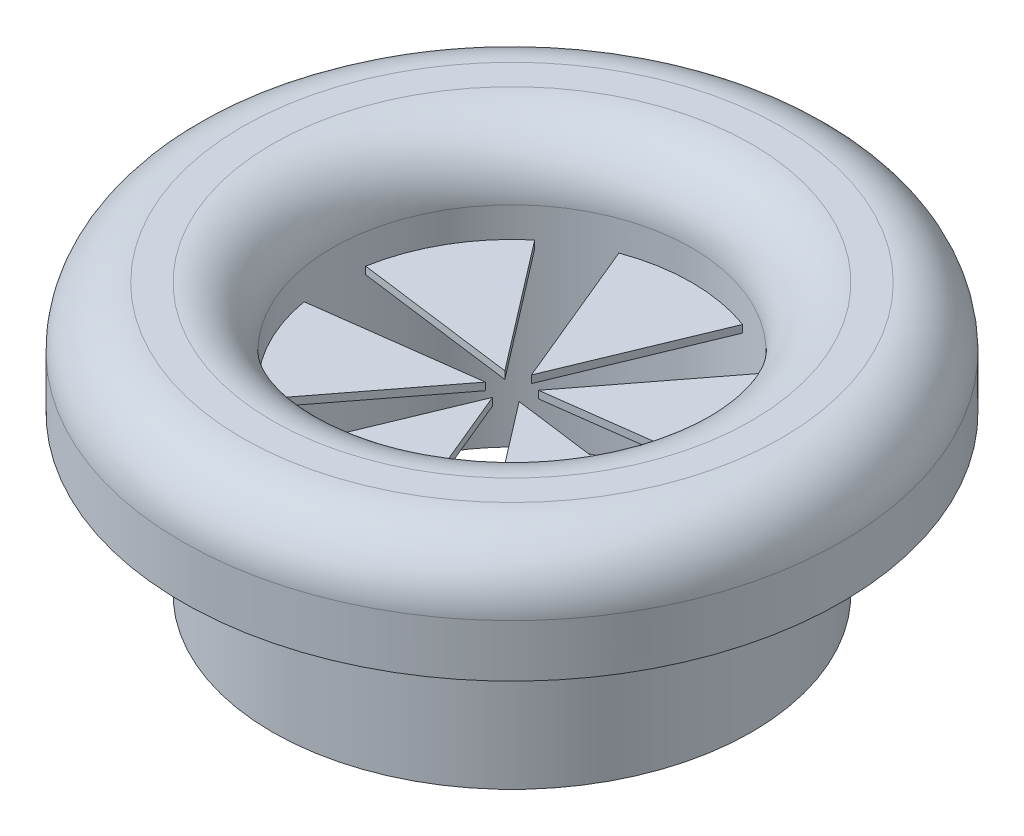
ISO-10303-21;
HEADER;
FILE_DESCRIPTION(('STEP AP214'),'2;1');
FILE_NAME('part.step','',(''),(''),'','','');
FILE_SCHEMA(('AUTOMOTIVE_DESIGN { 1 0 10303 214 1 1 1 1 }'));
ENDSEC;
DATA;
#1=APPLICATION_CONTEXT('core data for automotive mechanical design processes');
#2=APPLICATION_PROTOCOL_DEFINITION('international standard','automotive_design',2000,#1);
#3=PRODUCT_CONTEXT('',#1,'mechanical');
#4=PRODUCT('Part','Part','',(#3));
#5=PRODUCT_RELATED_PRODUCT_CATEGORY('part','',(#4));
#6=PRODUCT_DEFINITION_FORMATION('','',#4);
#7=PRODUCT_DEFINITION_CONTEXT('part definition',#1,'design');
#8=PRODUCT_DEFINITION('design','',#6,#7);
#9=PRODUCT_DEFINITION_SHAPE('','',#8);
#10=(LENGTH_UNIT() NAMED_UNIT(*) SI_UNIT(.MILLI.,.METRE.));
#11=(NAMED_UNIT(*) PLANE_ANGLE_UNIT() SI_UNIT($,.RADIAN.));
#12=(NAMED_UNIT(*) SI_UNIT($,.STERADIAN.) SOLID_ANGLE_UNIT());
#13=UNCERTAINTY_MEASURE_WITH_UNIT(LENGTH_MEASURE(1.E-05),#10,'distance_accuracy_value','');
#14=(GEOMETRIC_REPRESENTATION_CONTEXT(3) GLOBAL_UNCERTAINTY_ASSIGNED_CONTEXT((#13)) GLOBAL_UNIT_ASSIGNED_CONTEXT((#10,
#11,#12)) REPRESENTATION_CONTEXT('',''));
#15=CARTESIAN_POINT('',(0.,0.,0.));
#16=DIRECTION('',(0.,0.,1.));
#17=DIRECTION('',(1.,0.,0.));
#18=AXIS2_PLACEMENT_3D('',#15,#16,#17);
#19=CARTESIAN_POINT('',(0.,9.,0.));
#20=DIRECTION('',(0.,-1.,0.));
#21=DIRECTION('',(0.,0.,-1.));
#22=AXIS2_PLACEMENT_3D('',#19,#20,#21);
#23=CYLINDRICAL_SURFACE('',#22,11.);
#24=CARTESIAN_POINT('',(0.,7.,0.));
#25=DIRECTION('',(0.,1.,0.));
#26=DIRECTION('',(0.,0.,1.));
#27=AXIS2_PLACEMENT_3D('',#24,#25,#26);
#28=CIRCLE('',#27,11.);
#29=CARTESIAN_POINT('',(0.,7.,11.));
#30=VERTEX_POINT('',#29);
#31=EDGE_CURVE('E40',#30,#30,#28,.F.);
#32=ORIENTED_EDGE('',*,*,#31,.T.);
#33=EDGE_LOOP('',(#32));
#34=FACE_BOUND('',#33,.T.);
#35=CARTESIAN_POINT('',(0.,5.25,0.));
#36=DIRECTION('',(0.,-1.,0.));
#37=DIRECTION('',(0.,0.,-1.));
#38=AXIS2_PLACEMENT_3D('',#35,#36,#37);
#39=CIRCLE('',#38,11.);
#40=CARTESIAN_POINT('',(0.,5.25,-11.));
#41=VERTEX_POINT('',#40);
#42=EDGE_CURVE('E186',#41,#41,#39,.T.);
#43=ORIENTED_EDGE('',*,*,#42,.F.);
#44=EDGE_LOOP('',(#43));
#45=FACE_BOUND('',#44,.T.);
#46=ADVANCED_FACE('F32',(#34,#45),#23,.T.);
#47=CARTESIAN_POINT('',(0.,5.,0.));
#48=DIRECTION('',(0.,1.,0.));
#49=DIRECTION('',(0.,0.,1.));
#50=AXIS2_PLACEMENT_3D('',#47,#48,#49);
#51=PLANE('',#50);
#52=CARTESIAN_POINT('',(0.,5.,0.));
#53=DIRECTION('',(0.,1.,0.));
#54=DIRECTION('',(0.,0.,1.));
#55=AXIS2_PLACEMENT_3D('',#52,#53,#54);
#56=CIRCLE('',#55,8.);
#57=CARTESIAN_POINT('',(0.,5.,8.));
#58=VERTEX_POINT('',#57);
#59=EDGE_CURVE('E307',#58,#58,#56,.T.);
#60=ORIENTED_EDGE('',*,*,#59,.T.);
#61=EDGE_LOOP('',(#60));
#62=FACE_BOUND('',#61,.T.);
#63=CARTESIAN_POINT('',(0.,5.,0.));
#64=DIRECTION('',(0.,-1.,0.));
#65=DIRECTION('',(0.,0.,-1.));
#66=AXIS2_PLACEMENT_3D('',#63,#64,#65);
#67=CIRCLE('',#66,10.);
#68=CARTESIAN_POINT('',(0.,5.,-10.));
#69=VERTEX_POINT('',#68);
#70=EDGE_CURVE('E408',#69,#69,#67,.T.);
#71=ORIENTED_EDGE('',*,*,#70,.T.);
#72=EDGE_LOOP('',(#71));
#73=FACE_BOUND('',#72,.T.);
#74=ADVANCED_FACE('F343',(#62,#73),#51,.F.);
#75=CARTESIAN_POINT('',(0.,0.,0.));
#76=DIRECTION('',(0.,1.,0.));
#77=DIRECTION('',(0.,0.,1.));
#78=AXIS2_PLACEMENT_3D('',#75,#76,#77);
#79=CYLINDRICAL_SURFACE('',#78,6.);
#80=CARTESIAN_POINT('',(0.,7.,0.));
#81=DIRECTION('',(0.,1.,0.));
#82=DIRECTION('',(0.,0.,1.));
#83=AXIS2_PLACEMENT_3D('',#80,#81,#82);
#84=CIRCLE('',#83,6.);
#85=CARTESIAN_POINT('',(0.,7.,6.));
#86=VERTEX_POINT('',#85);
#87=EDGE_CURVE('E11',#86,#86,#84,.T.);
#88=ORIENTED_EDGE('',*,*,#87,.T.);
#89=EDGE_LOOP('',(#88));
#90=FACE_BOUND('',#89,.T.);
#91=CARTESIAN_POINT('',(0.,5.75,-1.28369537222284E-13));
#92=DIRECTION('',(0.,-1.,0.));
#93=DIRECTION('',(0.,0.,1.));
#94=AXIS2_PLACEMENT_3D('',#91,#92,#93);
#95=CIRCLE('',#94,5.99999999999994);
#96=CARTESIAN_POINT('',(-5.91108730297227,5.75,-1.02910004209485));
#97=VERTEX_POINT('',#96);
#98=CARTESIAN_POINT('',(-3.84677043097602,5.75,-4.60460174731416));
#99=VERTEX_POINT('',#98);
#100=EDGE_CURVE('E193',#97,#99,#95,.T.);
#101=ORIENTED_EDGE('',*,*,#100,.F.);
#102=DIRECTION('',(0.,1.,0.));
#103=VECTOR('',#102,1.);
#104=CARTESIAN_POINT('',(-5.91108730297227,5.75,-1.02910004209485));
#105=LINE('',#104,#103);
#106=CARTESIAN_POINT('',(-5.91108730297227,6.,-1.02910004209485));
#107=VERTEX_POINT('',#106);
#108=EDGE_CURVE('E208',#97,#107,#105,.T.);
#109=ORIENTED_EDGE('',*,*,#108,.T.);
#110=CARTESIAN_POINT('',(0.,6.,-1.28369537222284E-13));
#111=DIRECTION('',(0.,-1.,0.));
#112=DIRECTION('',(0.,0.,1.));
#113=AXIS2_PLACEMENT_3D('',#110,#111,#112);
#114=CIRCLE('',#113,5.99999999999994);
#115=CARTESIAN_POINT('',(-3.84677043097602,6.,-4.60460174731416));
#116=VERTEX_POINT('',#115);
#117=EDGE_CURVE('E200',#107,#116,#114,.T.);
#118=ORIENTED_EDGE('',*,*,#117,.T.);
#119=DIRECTION('',(0.,1.,0.));
#120=VECTOR('',#119,1.);
#121=CARTESIAN_POINT('',(-3.84677043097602,5.75,-4.60460174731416));
#122=LINE('',#121,#120);
#123=EDGE_CURVE('E206',#99,#116,#122,.T.);
#124=ORIENTED_EDGE('',*,*,#123,.F.);
#125=EDGE_LOOP('',(#101,#109,#118,#124));
#126=FACE_BOUND('',#125,.T.);
#127=CARTESIAN_POINT('',(0.,5.75,-1.28369537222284E-13));
#128=DIRECTION('',(0.,-1.,0.));
#129=DIRECTION('',(0.,0.,1.));
#130=AXIS2_PLACEMENT_3D('',#127,#128,#129);
#131=CIRCLE('',#130,5.99999999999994);
#132=CARTESIAN_POINT('',(3.84677043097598,5.75,-4.60460174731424));
#133=VERTEX_POINT('',#132);
#134=CARTESIAN_POINT('',(5.91108730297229,5.75,-1.02910004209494));
#135=VERTEX_POINT('',#134);
#136=EDGE_CURVE('E237',#133,#135,#131,.T.);
#137=ORIENTED_EDGE('',*,*,#136,.F.);
#138=DIRECTION('',(0.,1.,0.));
#139=VECTOR('',#138,1.);
#140=CARTESIAN_POINT('',(3.84677043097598,5.75,-4.60460174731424));
#141=LINE('',#140,#139);
#142=CARTESIAN_POINT('',(3.84677043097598,6.,-4.60460174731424));
#143=VERTEX_POINT('',#142);
#144=EDGE_CURVE('E254',#133,#143,#141,.T.);
#145=ORIENTED_EDGE('',*,*,#144,.T.);
#146=CARTESIAN_POINT('',(0.,6.,-1.28369537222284E-13));
#147=DIRECTION('',(0.,-1.,0.));
#148=DIRECTION('',(0.,0.,1.));
#149=AXIS2_PLACEMENT_3D('',#146,#147,#148);
#150=CIRCLE('',#149,5.99999999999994);
#151=CARTESIAN_POINT('',(5.91108730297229,6.,-1.02910004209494));
#152=VERTEX_POINT('',#151);
#153=EDGE_CURVE('E245',#143,#152,#150,.T.);
#154=ORIENTED_EDGE('',*,*,#153,.T.);
#155=DIRECTION('',(0.,1.,0.));
#156=VECTOR('',#155,1.);
#157=CARTESIAN_POINT('',(5.91108730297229,5.75,-1.02910004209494));
#158=LINE('',#157,#156);
#159=EDGE_CURVE('E251',#135,#152,#158,.T.);
#160=ORIENTED_EDGE('',*,*,#159,.F.);
#161=EDGE_LOOP('',(#137,#145,#154,#160));
#162=FACE_BOUND('',#161,.T.);
#163=CARTESIAN_POINT('',(0.,5.75,-1.28369537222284E-13));
#164=DIRECTION('',(0.,-1.,0.));
#165=DIRECTION('',(0.,0.,1.));
#166=AXIS2_PLACEMENT_3D('',#163,#164,#165);
#167=CIRCLE('',#166,6.00000000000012);
#168=CARTESIAN_POINT('',(2.06431687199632,5.75,5.63370178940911));
#169=VERTEX_POINT('',#168);
#170=CARTESIAN_POINT('',(-2.06431687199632,5.75,5.63370178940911));
#171=VERTEX_POINT('',#170);
#172=EDGE_CURVE('E283',#169,#171,#167,.T.);
#173=ORIENTED_EDGE('',*,*,#172,.F.);
#174=DIRECTION('',(0.,1.,0.));
#175=VECTOR('',#174,1.);
#176=CARTESIAN_POINT('',(2.06431687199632,5.75,5.63370178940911));
#177=LINE('',#176,#175);
#178=CARTESIAN_POINT('',(2.06431687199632,6.,5.63370178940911));
#179=VERTEX_POINT('',#178);
#180=EDGE_CURVE('E300',#169,#179,#177,.T.);
#181=ORIENTED_EDGE('',*,*,#180,.T.);
#182=CARTESIAN_POINT('',(0.,6.,-1.28369537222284E-13));
#183=DIRECTION('',(0.,-1.,0.));
#184=DIRECTION('',(0.,0.,1.));
#185=AXIS2_PLACEMENT_3D('',#182,#183,#184);
#186=CIRCLE('',#185,6.00000000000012);
#187=CARTESIAN_POINT('',(-2.06431687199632,6.,5.63370178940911));
#188=VERTEX_POINT('',#187);
#189=EDGE_CURVE('E291',#179,#188,#186,.T.);
#190=ORIENTED_EDGE('',*,*,#189,.T.);
#191=DIRECTION('',(0.,1.,0.));
#192=VECTOR('',#191,1.);
#193=CARTESIAN_POINT('',(-2.06431687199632,5.75,5.63370178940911));
#194=LINE('',#193,#192);
#195=EDGE_CURVE('E297',#171,#188,#194,.T.);
#196=ORIENTED_EDGE('',*,*,#195,.F.);
#197=EDGE_LOOP('',(#173,#181,#190,#196));
#198=FACE_BOUND('',#197,.T.);
#199=CARTESIAN_POINT('',(0.,0.,0.));
#200=DIRECTION('',(0.,1.,0.));
#201=DIRECTION('',(0.,0.,1.));
#202=AXIS2_PLACEMENT_3D('',#199,#200,#201);
#203=CIRCLE('',#202,6.);
#204=CARTESIAN_POINT('',(0.,0.,6.));
#205=VERTEX_POINT('',#204);
#206=EDGE_CURVE('E303',#205,#205,#203,.T.);
#207=ORIENTED_EDGE('',*,*,#206,.F.);
#208=EDGE_LOOP('',(#207));
#209=FACE_BOUND('',#208,.T.);
#210=CARTESIAN_POINT('',(0.,5.75,-1.28369537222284E-13));
#211=DIRECTION('',(0.,-1.,0.));
#212=DIRECTION('',(0.,0.,1.));
#213=AXIS2_PLACEMENT_3D('',#210,#211,#212);
#214=CIRCLE('',#213,6.00000000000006);
#215=CARTESIAN_POINT('',(5.91108730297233,5.75,1.02910004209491));
#216=VERTEX_POINT('',#215);
#217=CARTESIAN_POINT('',(3.84677043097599,5.75,4.60460174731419));
#218=VERTEX_POINT('',#217);
#219=EDGE_CURVE('E260',#216,#218,#214,.T.);
#220=ORIENTED_EDGE('',*,*,#219,.F.);
#221=DIRECTION('',(0.,1.,0.));
#222=VECTOR('',#221,1.);
#223=CARTESIAN_POINT('',(5.91108730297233,5.75,1.02910004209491));
#224=LINE('',#223,#222);
#225=CARTESIAN_POINT('',(5.91108730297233,6.,1.02910004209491));
#226=VERTEX_POINT('',#225);
#227=EDGE_CURVE('E277',#216,#226,#224,.T.);
#228=ORIENTED_EDGE('',*,*,#227,.T.);
#229=CARTESIAN_POINT('',(0.,6.,-1.28369537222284E-13));
#230=DIRECTION('',(0.,-1.,0.));
#231=DIRECTION('',(0.,0.,1.));
#232=AXIS2_PLACEMENT_3D('',#229,#230,#231);
#233=CIRCLE('',#232,6.00000000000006);
#234=CARTESIAN_POINT('',(3.84677043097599,6.,4.60460174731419));
#235=VERTEX_POINT('',#234);
#236=EDGE_CURVE('E268',#226,#235,#233,.T.);
#237=ORIENTED_EDGE('',*,*,#236,.T.);
#238=DIRECTION('',(0.,1.,0.));
#239=VECTOR('',#238,1.);
#240=CARTESIAN_POINT('',(3.84677043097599,5.75,4.60460174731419));
#241=LINE('',#240,#239);
#242=EDGE_CURVE('E274',#218,#235,#241,.T.);
#243=ORIENTED_EDGE('',*,*,#242,.F.);
#244=EDGE_LOOP('',(#220,#228,#237,#243));
#245=FACE_BOUND('',#244,.T.);
#246=CARTESIAN_POINT('',(0.,5.75,-1.28369537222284E-13));
#247=DIRECTION('',(0.,-1.,0.));
#248=DIRECTION('',(0.,0.,1.));
#249=AXIS2_PLACEMENT_3D('',#246,#247,#248);
#250=CIRCLE('',#249,5.99999999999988);
#251=CARTESIAN_POINT('',(-2.06431687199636,5.75,-5.63370178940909));
#252=VERTEX_POINT('',#251);
#253=CARTESIAN_POINT('',(2.06431687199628,5.75,-5.63370178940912));
#254=VERTEX_POINT('',#253);
#255=EDGE_CURVE('E214',#252,#254,#250,.T.);
#256=ORIENTED_EDGE('',*,*,#255,.F.);
#257=DIRECTION('',(0.,1.,0.));
#258=VECTOR('',#257,1.);
#259=CARTESIAN_POINT('',(-2.06431687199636,5.75,-5.63370178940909));
#260=LINE('',#259,#258);
#261=CARTESIAN_POINT('',(-2.06431687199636,6.,-5.63370178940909));
#262=VERTEX_POINT('',#261);
#263=EDGE_CURVE('E231',#252,#262,#260,.T.);
#264=ORIENTED_EDGE('',*,*,#263,.T.);
#265=CARTESIAN_POINT('',(0.,6.,-1.28369537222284E-13));
#266=DIRECTION('',(0.,-1.,0.));
#267=DIRECTION('',(0.,0.,1.));
#268=AXIS2_PLACEMENT_3D('',#265,#266,#267);
#269=CIRCLE('',#268,5.99999999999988);
#270=CARTESIAN_POINT('',(2.06431687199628,6.,-5.63370178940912));
#271=VERTEX_POINT('',#270);
#272=EDGE_CURVE('E222',#262,#271,#269,.T.);
#273=ORIENTED_EDGE('',*,*,#272,.T.);
#274=DIRECTION('',(0.,1.,0.));
#275=VECTOR('',#274,1.);
#276=CARTESIAN_POINT('',(2.06431687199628,5.75,-5.63370178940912));
#277=LINE('',#276,#275);
#278=EDGE_CURVE('E228',#254,#271,#277,.T.);
#279=ORIENTED_EDGE('',*,*,#278,.F.);
#280=EDGE_LOOP('',(#256,#264,#273,#279));
#281=FACE_BOUND('',#280,.T.);
#282=CARTESIAN_POINT('',(0.,5.75,-1.28369537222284E-13));
#283=DIRECTION('',(0.,-1.,0.));
#284=DIRECTION('',(0.,0.,1.));
#285=AXIS2_PLACEMENT_3D('',#282,#283,#284);
#286=CIRCLE('',#285,6.00000000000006);
#287=CARTESIAN_POINT('',(-3.8467704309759,5.75,4.60460174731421));
#288=VERTEX_POINT('',#287);
#289=CARTESIAN_POINT('',(-5.91108730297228,5.75,1.02910004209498));
#290=VERTEX_POINT('',#289);
#291=EDGE_CURVE('E160',#288,#290,#286,.T.);
#292=ORIENTED_EDGE('',*,*,#291,.F.);
#293=DIRECTION('',(0.,1.,0.));
#294=VECTOR('',#293,1.);
#295=CARTESIAN_POINT('',(-3.8467704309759,5.75,4.60460174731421));
#296=LINE('',#295,#294);
#297=CARTESIAN_POINT('',(-3.8467704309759,6.,4.60460174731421));
#298=VERTEX_POINT('',#297);
#299=EDGE_CURVE('E169',#288,#298,#296,.T.);
#300=ORIENTED_EDGE('',*,*,#299,.T.);
#301=CARTESIAN_POINT('',(0.,6.,-1.28369537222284E-13));
#302=DIRECTION('',(0.,-1.,0.));
#303=DIRECTION('',(0.,0.,1.));
#304=AXIS2_PLACEMENT_3D('',#301,#302,#303);
#305=CIRCLE('',#304,6.00000000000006);
#306=CARTESIAN_POINT('',(-5.91108730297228,6.,1.02910004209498));
#307=VERTEX_POINT('',#306);
#308=EDGE_CURVE('E185',#298,#307,#305,.T.);
#309=ORIENTED_EDGE('',*,*,#308,.T.);
#310=DIRECTION('',(0.,1.,0.));
#311=VECTOR('',#310,1.);
#312=CARTESIAN_POINT('',(-5.91108730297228,5.75,1.02910004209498));
#313=LINE('',#312,#311);
#314=EDGE_CURVE('E175',#290,#307,#313,.T.);
#315=ORIENTED_EDGE('',*,*,#314,.F.);
#316=EDGE_LOOP('',(#292,#300,#309,#315));
#317=FACE_BOUND('',#316,.T.);
#318=ADVANCED_FACE('F178',(#90,#126,#162,#198,#209,#245,#281,#317),#79,.F.);
#319=CARTESIAN_POINT('',(0.,5.,0.));
#320=DIRECTION('',(0.,-1.,0.));
#321=DIRECTION('',(0.,0.,-1.));
#322=AXIS2_PLACEMENT_3D('',#319,#320,#321);
#323=CYLINDRICAL_SURFACE('',#322,8.);
#324=ORIENTED_EDGE('',*,*,#59,.F.);
#325=EDGE_LOOP('',(#324));
#326=FACE_BOUND('',#325,.T.);
#327=CARTESIAN_POINT('',(0.,0.,0.));
#328=DIRECTION('',(0.,1.,0.));
#329=DIRECTION('',(0.,0.,1.));
#330=AXIS2_PLACEMENT_3D('',#327,#328,#329);
#331=CIRCLE('',#330,8.);
#332=CARTESIAN_POINT('',(0.,0.,8.));
#333=VERTEX_POINT('',#332);
#334=EDGE_CURVE('E306',#333,#333,#331,.T.);
#335=ORIENTED_EDGE('',*,*,#334,.T.);
#336=EDGE_LOOP('',(#335));
#337=FACE_BOUND('',#336,.T.);
#338=ADVANCED_FACE('F342',(#326,#337),#323,.T.);
#339=CARTESIAN_POINT('',(0.,0.,0.));
#340=DIRECTION('',(0.,1.,0.));
#341=DIRECTION('',(0.,0.,1.));
#342=AXIS2_PLACEMENT_3D('',#339,#340,#341);
#343=PLANE('',#342);
#344=ORIENTED_EDGE('',*,*,#206,.T.);
#345=EDGE_LOOP('',(#344));
#346=FACE_BOUND('',#345,.T.);
#347=ORIENTED_EDGE('',*,*,#334,.F.);
#348=EDGE_LOOP('',(#347));
#349=FACE_BOUND('',#348,.T.);
#350=ADVANCED_FACE('F332',(#346,#349),#343,.F.);
#351=CARTESIAN_POINT('',(0.,9.,0.));
#352=DIRECTION('',(0.,1.,0.));
#353=DIRECTION('',(0.,0.,1.));
#354=AXIS2_PLACEMENT_3D('',#351,#352,#353);
#355=PLANE('',#354);
#356=CARTESIAN_POINT('',(0.,9.,0.));
#357=DIRECTION('',(0.,1.,0.));
#358=DIRECTION('',(0.,0.,1.));
#359=AXIS2_PLACEMENT_3D('',#356,#357,#358);
#360=CIRCLE('',#359,9.);
#361=CARTESIAN_POINT('',(0.,9.,9.));
#362=VERTEX_POINT('',#361);
#363=EDGE_CURVE('E315',#362,#362,#360,.T.);
#364=ORIENTED_EDGE('',*,*,#363,.T.);
#365=EDGE_LOOP('',(#364));
#366=FACE_BOUND('',#365,.T.);
#367=CARTESIAN_POINT('',(0.,9.,0.));
#368=DIRECTION('',(0.,1.,0.));
#369=DIRECTION('',(0.,0.,1.));
#370=AXIS2_PLACEMENT_3D('',#367,#368,#369);
#371=CIRCLE('',#370,8.);
#372=CARTESIAN_POINT('',(0.,9.,8.));
#373=VERTEX_POINT('',#372);
#374=EDGE_CURVE('E310',#373,#373,#371,.F.);
#375=ORIENTED_EDGE('',*,*,#374,.T.);
#376=EDGE_LOOP('',(#375));
#377=FACE_BOUND('',#376,.T.);
#378=ADVANCED_FACE('F328',(#366,#377),#355,.T.);
#379=CARTESIAN_POINT('',(0.,5.75,0.65));
#380=DIRECTION('',(-0.923879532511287,0.,0.38268343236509));
#381=DIRECTION('',(0.38268343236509,0.,0.923879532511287));
#382=AXIS2_PLACEMENT_3D('',#379,#380,#381);
#383=PLANE('',#382);
#384=DIRECTION('',(0.38268343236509,0.,0.923879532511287));
#385=VECTOR('',#384,1.);
#386=CARTESIAN_POINT('',(0.,6.,0.65));
#387=LINE('',#386,#385);
#388=CARTESIAN_POINT('',(0.,6.,0.65));
#389=VERTEX_POINT('',#388);
#390=EDGE_CURVE('E280',#389,#179,#387,.T.);
#391=ORIENTED_EDGE('',*,*,#390,.T.);
#392=ORIENTED_EDGE('',*,*,#180,.F.);
#393=DIRECTION('',(0.38268343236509,0.,0.923879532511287));
#394=VECTOR('',#393,1.);
#395=CARTESIAN_POINT('',(0.,5.75,0.65));
#396=LINE('',#395,#394);
#397=CARTESIAN_POINT('',(0.,5.75,0.65));
#398=VERTEX_POINT('',#397);
#399=EDGE_CURVE('E281',#398,#169,#396,.T.);
#400=ORIENTED_EDGE('',*,*,#399,.F.);
#401=DIRECTION('',(0.,1.,0.));
#402=VECTOR('',#401,1.);
#403=CARTESIAN_POINT('',(0.,5.75,0.65));
#404=LINE('',#403,#402);
#405=EDGE_CURVE('E288',#398,#389,#404,.T.);
#406=ORIENTED_EDGE('',*,*,#405,.T.);
#407=EDGE_LOOP('',(#391,#392,#400,#406));
#408=FACE_BOUND('',#407,.T.);
#409=ADVANCED_FACE('F331',(#408),#383,.F.);
#410=CARTESIAN_POINT('',(0.,5.75,0.65));
#411=DIRECTION('',(0.923879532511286,0.,0.382683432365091));
#412=DIRECTION('',(0.382683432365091,0.,-0.923879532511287));
#413=AXIS2_PLACEMENT_3D('',#410,#411,#412);
#414=PLANE('',#413);
#415=DIRECTION('',(0.382683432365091,0.,-0.923879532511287));
#416=VECTOR('',#415,1.);
#417=CARTESIAN_POINT('',(0.,6.,0.65));
#418=LINE('',#417,#416);
#419=EDGE_CURVE('E284',#188,#389,#418,.T.);
#420=ORIENTED_EDGE('',*,*,#419,.T.);
#421=ORIENTED_EDGE('',*,*,#405,.F.);
#422=DIRECTION('',(0.382683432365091,0.,-0.923879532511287));
#423=VECTOR('',#422,1.);
#424=CARTESIAN_POINT('',(0.,5.75,0.65));
#425=LINE('',#424,#423);
#426=EDGE_CURVE('E286',#171,#398,#425,.T.);
#427=ORIENTED_EDGE('',*,*,#426,.F.);
#428=ORIENTED_EDGE('',*,*,#195,.T.);
#429=EDGE_LOOP('',(#420,#421,#427,#428));
#430=FACE_BOUND('',#429,.T.);
#431=ADVANCED_FACE('F536',(#430),#414,.F.);
#432=CARTESIAN_POINT('',(0.,5.75,-1.28369537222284E-13));
#433=DIRECTION('',(0.,1.,0.));
#434=DIRECTION('',(0.,0.,1.));
#435=AXIS2_PLACEMENT_3D('',#432,#433,#434);
#436=PLANE('',#435);
#437=ORIENTED_EDGE('',*,*,#399,.T.);
#438=ORIENTED_EDGE('',*,*,#172,.T.);
#439=ORIENTED_EDGE('',*,*,#426,.T.);
#440=EDGE_LOOP('',(#437,#438,#439));
#441=FACE_BOUND('',#440,.T.);
#442=ADVANCED_FACE('F543',(#441),#436,.F.);
#443=CARTESIAN_POINT('',(0.,6.,-1.28369537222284E-13));
#444=DIRECTION('',(0.,1.,0.));
#445=DIRECTION('',(0.,0.,1.));
#446=AXIS2_PLACEMENT_3D('',#443,#444,#445);
#447=PLANE('',#446);
#448=ORIENTED_EDGE('',*,*,#390,.F.);
#449=ORIENTED_EDGE('',*,*,#419,.F.);
#450=ORIENTED_EDGE('',*,*,#189,.F.);
#451=EDGE_LOOP('',(#448,#449,#450));
#452=FACE_BOUND('',#451,.T.);
#453=ADVANCED_FACE('F551',(#452),#447,.T.);
#454=CARTESIAN_POINT('',(0.562916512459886,5.75,0.324999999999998));
#455=DIRECTION('',(-0.130526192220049,0.,0.991444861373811));
#456=DIRECTION('',(0.991444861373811,0.,0.130526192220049));
#457=AXIS2_PLACEMENT_3D('',#454,#455,#456);
#458=PLANE('',#457);
#459=DIRECTION('',(0.991444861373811,0.,0.130526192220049));
#460=VECTOR('',#459,1.);
#461=CARTESIAN_POINT('',(0.562916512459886,6.,0.324999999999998));
#462=LINE('',#461,#460);
#463=CARTESIAN_POINT('',(0.562916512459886,6.,0.324999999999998));
#464=VERTEX_POINT('',#463);
#465=EDGE_CURVE('E257',#464,#226,#462,.T.);
#466=ORIENTED_EDGE('',*,*,#465,.T.);
#467=ORIENTED_EDGE('',*,*,#227,.F.);
#468=DIRECTION('',(0.991444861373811,0.,0.130526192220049));
#469=VECTOR('',#468,1.);
#470=CARTESIAN_POINT('',(0.562916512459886,5.75,0.324999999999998));
#471=LINE('',#470,#469);
#472=CARTESIAN_POINT('',(0.562916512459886,5.75,0.324999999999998));
#473=VERTEX_POINT('',#472);
#474=EDGE_CURVE('E258',#473,#216,#471,.T.);
#475=ORIENTED_EDGE('',*,*,#474,.F.);
#476=DIRECTION('',(0.,1.,0.));
#477=VECTOR('',#476,1.);
#478=CARTESIAN_POINT('',(0.562916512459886,5.75,0.324999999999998));
#479=LINE('',#478,#477);
#480=EDGE_CURVE('E265',#473,#464,#479,.T.);
#481=ORIENTED_EDGE('',*,*,#480,.T.);
#482=EDGE_LOOP('',(#466,#467,#475,#481));
#483=FACE_BOUND('',#482,.T.);
#484=ADVANCED_FACE('F559',(#483),#458,.F.);
#485=CARTESIAN_POINT('',(0.562916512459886,5.75,0.324999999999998));
#486=DIRECTION('',(0.793353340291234,0.,-0.608761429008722));
#487=DIRECTION('',(-0.608761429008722,0.,-0.793353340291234));
#488=AXIS2_PLACEMENT_3D('',#485,#486,#487);
#489=PLANE('',#488);
#490=DIRECTION('',(-0.608761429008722,0.,-0.793353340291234));
#491=VECTOR('',#490,1.);
#492=CARTESIAN_POINT('',(0.562916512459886,6.,0.324999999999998));
#493=LINE('',#492,#491);
#494=EDGE_CURVE('E261',#235,#464,#493,.T.);
#495=ORIENTED_EDGE('',*,*,#494,.T.);
#496=ORIENTED_EDGE('',*,*,#480,.F.);
#497=DIRECTION('',(-0.608761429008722,0.,-0.793353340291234));
#498=VECTOR('',#497,1.);
#499=CARTESIAN_POINT('',(0.562916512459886,5.75,0.324999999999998));
#500=LINE('',#499,#498);
#501=EDGE_CURVE('E263',#218,#473,#500,.T.);
#502=ORIENTED_EDGE('',*,*,#501,.F.);
#503=ORIENTED_EDGE('',*,*,#242,.T.);
#504=EDGE_LOOP('',(#495,#496,#502,#503));
#505=FACE_BOUND('',#504,.T.);
#506=ADVANCED_FACE('F567',(#505),#489,.F.);
#507=CARTESIAN_POINT('',(0.,5.75,-1.28369537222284E-13));
#508=DIRECTION('',(0.,1.,0.));
#509=DIRECTION('',(0.,0.,1.));
#510=AXIS2_PLACEMENT_3D('',#507,#508,#509);
#511=PLANE('',#510);
#512=ORIENTED_EDGE('',*,*,#474,.T.);
#513=ORIENTED_EDGE('',*,*,#219,.T.);
#514=ORIENTED_EDGE('',*,*,#501,.T.);
#515=EDGE_LOOP('',(#512,#513,#514));
#516=FACE_BOUND('',#515,.T.);
#517=ADVANCED_FACE('F575',(#516),#511,.F.);
#518=CARTESIAN_POINT('',(0.,6.,-1.28369537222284E-13));
#519=DIRECTION('',(0.,1.,0.));
#520=DIRECTION('',(0.,0.,1.));
#521=AXIS2_PLACEMENT_3D('',#518,#519,#520);
#522=PLANE('',#521);
#523=ORIENTED_EDGE('',*,*,#465,.F.);
#524=ORIENTED_EDGE('',*,*,#494,.F.);
#525=ORIENTED_EDGE('',*,*,#236,.F.);
#526=EDGE_LOOP('',(#523,#524,#525));
#527=FACE_BOUND('',#526,.T.);
#528=ADVANCED_FACE('F583',(#527),#522,.T.);
#529=CARTESIAN_POINT('',(0.562916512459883,5.75,-0.325000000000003));
#530=DIRECTION('',(0.793353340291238,0.,0.608761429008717));
#531=DIRECTION('',(0.608761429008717,0.,-0.793353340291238));
#532=AXIS2_PLACEMENT_3D('',#529,#530,#531);
#533=PLANE('',#532);
#534=DIRECTION('',(0.608761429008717,0.,-0.793353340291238));
#535=VECTOR('',#534,1.);
#536=CARTESIAN_POINT('',(0.562916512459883,6.,-0.325000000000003));
#537=LINE('',#536,#535);
#538=CARTESIAN_POINT('',(0.562916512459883,6.,-0.325000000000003));
#539=VERTEX_POINT('',#538);
#540=EDGE_CURVE('E234',#539,#143,#537,.T.);
#541=ORIENTED_EDGE('',*,*,#540,.T.);
#542=ORIENTED_EDGE('',*,*,#144,.F.);
#543=DIRECTION('',(0.608761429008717,0.,-0.793353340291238));
#544=VECTOR('',#543,1.);
#545=CARTESIAN_POINT('',(0.562916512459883,5.75,-0.325000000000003));
#546=LINE('',#545,#544);
#547=CARTESIAN_POINT('',(0.562916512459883,5.75,-0.325000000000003));
#548=VERTEX_POINT('',#547);
#549=EDGE_CURVE('E235',#548,#133,#546,.T.);
#550=ORIENTED_EDGE('',*,*,#549,.F.);
#551=DIRECTION('',(0.,1.,0.));
#552=VECTOR('',#551,1.);
#553=CARTESIAN_POINT('',(0.562916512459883,5.75,-0.325000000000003));
#554=LINE('',#553,#552);
#555=EDGE_CURVE('E242',#548,#539,#554,.T.);
#556=ORIENTED_EDGE('',*,*,#555,.T.);
#557=EDGE_LOOP('',(#541,#542,#550,#556));
#558=FACE_BOUND('',#557,.T.);
#559=ADVANCED_FACE('F591',(#558),#533,.F.);
#560=CARTESIAN_POINT('',(0.562916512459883,5.75,-0.325000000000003));
#561=DIRECTION('',(-0.130526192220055,0.,-0.99144486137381));
#562=DIRECTION('',(-0.99144486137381,0.,0.130526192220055));
#563=AXIS2_PLACEMENT_3D('',#560,#561,#562);
#564=PLANE('',#563);
#565=DIRECTION('',(-0.99144486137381,0.,0.130526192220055));
#566=VECTOR('',#565,1.);
#567=CARTESIAN_POINT('',(0.562916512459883,6.,-0.325000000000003));
#568=LINE('',#567,#566);
#569=EDGE_CURVE('E238',#152,#539,#568,.T.);
#570=ORIENTED_EDGE('',*,*,#569,.T.);
#571=ORIENTED_EDGE('',*,*,#555,.F.);
#572=DIRECTION('',(-0.99144486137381,0.,0.130526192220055));
#573=VECTOR('',#572,1.);
#574=CARTESIAN_POINT('',(0.562916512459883,5.75,-0.325000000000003));
#575=LINE('',#574,#573);
#576=EDGE_CURVE('E240',#135,#548,#575,.T.);
#577=ORIENTED_EDGE('',*,*,#576,.F.);
#578=ORIENTED_EDGE('',*,*,#159,.T.);
#579=EDGE_LOOP('',(#570,#571,#577,#578));
#580=FACE_BOUND('',#579,.T.);
#581=ADVANCED_FACE('F599',(#580),#564,.F.);
#582=CARTESIAN_POINT('',(0.,5.75,-1.28369537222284E-13));
#583=DIRECTION('',(0.,1.,0.));
#584=DIRECTION('',(0.,0.,1.));
#585=AXIS2_PLACEMENT_3D('',#582,#583,#584);
#586=PLANE('',#585);
#587=ORIENTED_EDGE('',*,*,#549,.T.);
#588=ORIENTED_EDGE('',*,*,#136,.T.);
#589=ORIENTED_EDGE('',*,*,#576,.T.);
#590=EDGE_LOOP('',(#587,#588,#589));
#591=FACE_BOUND('',#590,.T.);
#592=ADVANCED_FACE('F607',(#591),#586,.F.);
#593=CARTESIAN_POINT('',(0.,6.,-1.28369537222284E-13));
#594=DIRECTION('',(0.,1.,0.));
#595=DIRECTION('',(0.,0.,1.));
#596=AXIS2_PLACEMENT_3D('',#593,#594,#595);
#597=PLANE('',#596);
#598=ORIENTED_EDGE('',*,*,#540,.F.);
#599=ORIENTED_EDGE('',*,*,#569,.F.);
#600=ORIENTED_EDGE('',*,*,#153,.F.);
#601=EDGE_LOOP('',(#598,#599,#600));
#602=FACE_BOUND('',#601,.T.);
#603=ADVANCED_FACE('F615',(#602),#597,.T.);
#604=CARTESIAN_POINT('',(0.,5.75,-0.65));
#605=DIRECTION('',(0.923879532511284,0.,-0.382683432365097));
#606=DIRECTION('',(-0.382683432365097,0.,-0.923879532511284));
#607=AXIS2_PLACEMENT_3D('',#604,#605,#606);
#608=PLANE('',#607);
#609=DIRECTION('',(-0.382683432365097,0.,-0.923879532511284));
#610=VECTOR('',#609,1.);
#611=CARTESIAN_POINT('',(0.,6.,-0.65));
#612=LINE('',#611,#610);
#613=CARTESIAN_POINT('',(0.,6.,-0.65));
#614=VERTEX_POINT('',#613);
#615=EDGE_CURVE('E211',#614,#262,#612,.T.);
#616=ORIENTED_EDGE('',*,*,#615,.T.);
#617=ORIENTED_EDGE('',*,*,#263,.F.);
#618=DIRECTION('',(-0.382683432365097,0.,-0.923879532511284));
#619=VECTOR('',#618,1.);
#620=CARTESIAN_POINT('',(0.,5.75,-0.65));
#621=LINE('',#620,#619);
#622=CARTESIAN_POINT('',(0.,5.75,-0.65));
#623=VERTEX_POINT('',#622);
#624=EDGE_CURVE('E212',#623,#252,#621,.T.);
#625=ORIENTED_EDGE('',*,*,#624,.F.);
#626=DIRECTION('',(0.,1.,0.));
#627=VECTOR('',#626,1.);
#628=CARTESIAN_POINT('',(0.,5.75,-0.65));
#629=LINE('',#628,#627);
#630=EDGE_CURVE('E219',#623,#614,#629,.T.);
#631=ORIENTED_EDGE('',*,*,#630,.T.);
#632=EDGE_LOOP('',(#616,#617,#625,#631));
#633=FACE_BOUND('',#632,.T.);
#634=ADVANCED_FACE('F371',(#633),#608,.F.);
#635=CARTESIAN_POINT('',(0.,5.75,-0.65));
#636=DIRECTION('',(-0.923879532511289,0.,-0.382683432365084));
#637=DIRECTION('',(-0.382683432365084,0.,0.923879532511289));
#638=AXIS2_PLACEMENT_3D('',#635,#636,#637);
#639=PLANE('',#638);
#640=DIRECTION('',(-0.382683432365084,0.,0.923879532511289));
#641=VECTOR('',#640,1.);
#642=CARTESIAN_POINT('',(0.,6.,-0.65));
#643=LINE('',#642,#641);
#644=EDGE_CURVE('E215',#271,#614,#643,.T.);
#645=ORIENTED_EDGE('',*,*,#644,.T.);
#646=ORIENTED_EDGE('',*,*,#630,.F.);
#647=DIRECTION('',(-0.382683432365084,0.,0.923879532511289));
#648=VECTOR('',#647,1.);
#649=CARTESIAN_POINT('',(0.,5.75,-0.65));
#650=LINE('',#649,#648);
#651=EDGE_CURVE('E217',#254,#623,#650,.T.);
#652=ORIENTED_EDGE('',*,*,#651,.F.);
#653=ORIENTED_EDGE('',*,*,#278,.T.);
#654=EDGE_LOOP('',(#645,#646,#652,#653));
#655=FACE_BOUND('',#654,.T.);
#656=ADVANCED_FACE('F368',(#655),#639,.F.);
#657=CARTESIAN_POINT('',(0.,5.75,-1.28369537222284E-13));
#658=DIRECTION('',(0.,1.,0.));
#659=DIRECTION('',(0.,0.,1.));
#660=AXIS2_PLACEMENT_3D('',#657,#658,#659);
#661=PLANE('',#660);
#662=ORIENTED_EDGE('',*,*,#624,.T.);
#663=ORIENTED_EDGE('',*,*,#255,.T.);
#664=ORIENTED_EDGE('',*,*,#651,.T.);
#665=EDGE_LOOP('',(#662,#663,#664));
#666=FACE_BOUND('',#665,.T.);
#667=ADVANCED_FACE('F364',(#666),#661,.F.);
#668=CARTESIAN_POINT('',(0.,6.,-1.28369537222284E-13));
#669=DIRECTION('',(0.,1.,0.));
#670=DIRECTION('',(0.,0.,1.));
#671=AXIS2_PLACEMENT_3D('',#668,#669,#670);
#672=PLANE('',#671);
#673=ORIENTED_EDGE('',*,*,#615,.F.);
#674=ORIENTED_EDGE('',*,*,#644,.F.);
#675=ORIENTED_EDGE('',*,*,#272,.F.);
#676=EDGE_LOOP('',(#673,#674,#675));
#677=FACE_BOUND('',#676,.T.);
#678=ADVANCED_FACE('F373',(#677),#672,.T.);
#679=CARTESIAN_POINT('',(-0.562916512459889,5.75,-0.324999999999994));
#680=DIRECTION('',(0.130526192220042,0.,-0.991444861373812));
#681=DIRECTION('',(-0.991444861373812,0.,-0.130526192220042));
#682=AXIS2_PLACEMENT_3D('',#679,#680,#681);
#683=PLANE('',#682);
#684=DIRECTION('',(-0.991444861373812,0.,-0.130526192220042));
#685=VECTOR('',#684,1.);
#686=CARTESIAN_POINT('',(-0.562916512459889,6.,-0.324999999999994));
#687=LINE('',#686,#685);
#688=CARTESIAN_POINT('',(-0.562916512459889,6.,-0.324999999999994));
#689=VERTEX_POINT('',#688);
#690=EDGE_CURVE('E174',#689,#107,#687,.T.);
#691=ORIENTED_EDGE('',*,*,#690,.T.);
#692=ORIENTED_EDGE('',*,*,#108,.F.);
#693=DIRECTION('',(-0.991444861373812,0.,-0.130526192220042));
#694=VECTOR('',#693,1.);
#695=CARTESIAN_POINT('',(-0.562916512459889,5.75,-0.324999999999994));
#696=LINE('',#695,#694);
#697=CARTESIAN_POINT('',(-0.562916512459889,5.75,-0.324999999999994));
#698=VERTEX_POINT('',#697);
#699=EDGE_CURVE('E191',#698,#97,#696,.T.);
#700=ORIENTED_EDGE('',*,*,#699,.F.);
#701=DIRECTION('',(0.,1.,0.));
#702=VECTOR('',#701,1.);
#703=CARTESIAN_POINT('',(-0.562916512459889,5.75,-0.324999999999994));
#704=LINE('',#703,#702);
#705=EDGE_CURVE('E197',#698,#689,#704,.T.);
#706=ORIENTED_EDGE('',*,*,#705,.T.);
#707=EDGE_LOOP('',(#691,#692,#700,#706));
#708=FACE_BOUND('',#707,.T.);
#709=ADVANCED_FACE('F375',(#708),#683,.F.);
#710=CARTESIAN_POINT('',(-0.562916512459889,5.75,-0.324999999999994));
#711=DIRECTION('',(-0.79335334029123,0.,0.608761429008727));
#712=DIRECTION('',(0.608761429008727,0.,0.79335334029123));
#713=AXIS2_PLACEMENT_3D('',#710,#711,#712);
#714=PLANE('',#713);
#715=DIRECTION('',(0.608761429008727,0.,0.79335334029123));
#716=VECTOR('',#715,1.);
#717=CARTESIAN_POINT('',(-0.562916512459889,6.,-0.324999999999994));
#718=LINE('',#717,#716);
#719=EDGE_CURVE('E55',#116,#689,#718,.T.);
#720=ORIENTED_EDGE('',*,*,#719,.T.);
#721=ORIENTED_EDGE('',*,*,#705,.F.);
#722=DIRECTION('',(0.608761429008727,0.,0.79335334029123));
#723=VECTOR('',#722,1.);
#724=CARTESIAN_POINT('',(-0.562916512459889,5.75,-0.324999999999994));
#725=LINE('',#724,#723);
#726=EDGE_CURVE('E195',#99,#698,#725,.T.);
#727=ORIENTED_EDGE('',*,*,#726,.F.);
#728=ORIENTED_EDGE('',*,*,#123,.T.);
#729=EDGE_LOOP('',(#720,#721,#727,#728));
#730=FACE_BOUND('',#729,.T.);
#731=ADVANCED_FACE('F381',(#730),#714,.F.);
#732=CARTESIAN_POINT('',(0.,5.75,-1.28369537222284E-13));
#733=DIRECTION('',(0.,1.,0.));
#734=DIRECTION('',(0.,0.,1.));
#735=AXIS2_PLACEMENT_3D('',#732,#733,#734);
#736=PLANE('',#735);
#737=ORIENTED_EDGE('',*,*,#699,.T.);
#738=ORIENTED_EDGE('',*,*,#100,.T.);
#739=ORIENTED_EDGE('',*,*,#726,.T.);
#740=EDGE_LOOP('',(#737,#738,#739));
#741=FACE_BOUND('',#740,.T.);
#742=ADVANCED_FACE('F440',(#741),#736,.F.);
#743=CARTESIAN_POINT('',(0.,6.,-1.28369537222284E-13));
#744=DIRECTION('',(0.,1.,0.));
#745=DIRECTION('',(0.,0.,1.));
#746=AXIS2_PLACEMENT_3D('',#743,#744,#745);
#747=PLANE('',#746);
#748=ORIENTED_EDGE('',*,*,#690,.F.);
#749=ORIENTED_EDGE('',*,*,#719,.F.);
#750=ORIENTED_EDGE('',*,*,#117,.F.);
#751=EDGE_LOOP('',(#748,#749,#750));
#752=FACE_BOUND('',#751,.T.);
#753=ADVANCED_FACE('F439',(#752),#747,.T.);
#754=CARTESIAN_POINT('',(-0.562916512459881,5.75,0.325000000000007));
#755=DIRECTION('',(-0.793353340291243,0.,-0.608761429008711));
#756=DIRECTION('',(-0.608761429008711,0.,0.793353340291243));
#757=AXIS2_PLACEMENT_3D('',#754,#755,#756);
#758=PLANE('',#757);
#759=DIRECTION('',(-0.608761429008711,0.,0.793353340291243));
#760=VECTOR('',#759,1.);
#761=CARTESIAN_POINT('',(-0.562916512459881,6.,0.325000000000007));
#762=LINE('',#761,#760);
#763=CARTESIAN_POINT('',(-0.562916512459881,6.,0.325000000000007));
#764=VERTEX_POINT('',#763);
#765=EDGE_CURVE('E171',#764,#298,#762,.T.);
#766=ORIENTED_EDGE('',*,*,#765,.T.);
#767=ORIENTED_EDGE('',*,*,#299,.F.);
#768=DIRECTION('',(-0.608761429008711,0.,0.793353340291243));
#769=VECTOR('',#768,1.);
#770=CARTESIAN_POINT('',(-0.562916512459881,5.75,0.325000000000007));
#771=LINE('',#770,#769);
#772=CARTESIAN_POINT('',(-0.562916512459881,5.75,0.325000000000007));
#773=VERTEX_POINT('',#772);
#774=EDGE_CURVE('E156',#773,#288,#771,.T.);
#775=ORIENTED_EDGE('',*,*,#774,.F.);
#776=DIRECTION('',(0.,1.,0.));
#777=VECTOR('',#776,1.);
#778=CARTESIAN_POINT('',(-0.562916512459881,5.75,0.325000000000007));
#779=LINE('',#778,#777);
#780=EDGE_CURVE('E180',#773,#764,#779,.T.);
#781=ORIENTED_EDGE('',*,*,#780,.T.);
#782=EDGE_LOOP('',(#766,#767,#775,#781));
#783=FACE_BOUND('',#782,.T.);
#784=ADVANCED_FACE('F170',(#783),#758,.F.);
#785=CARTESIAN_POINT('',(-0.562916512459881,5.75,0.325000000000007));
#786=DIRECTION('',(0.130526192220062,0.,0.991444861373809));
#787=DIRECTION('',(0.991444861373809,0.,-0.130526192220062));
#788=AXIS2_PLACEMENT_3D('',#785,#786,#787);
#789=PLANE('',#788);
#790=DIRECTION('',(0.991444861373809,0.,-0.130526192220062));
#791=VECTOR('',#790,1.);
#792=CARTESIAN_POINT('',(-0.562916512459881,6.,0.325000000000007));
#793=LINE('',#792,#791);
#794=EDGE_CURVE('E47',#307,#764,#793,.T.);
#795=ORIENTED_EDGE('',*,*,#794,.T.);
#796=ORIENTED_EDGE('',*,*,#780,.F.);
#797=DIRECTION('',(0.991444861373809,0.,-0.130526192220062));
#798=VECTOR('',#797,1.);
#799=CARTESIAN_POINT('',(-0.562916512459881,5.75,0.325000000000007));
#800=LINE('',#799,#798);
#801=EDGE_CURVE('E162',#290,#773,#800,.T.);
#802=ORIENTED_EDGE('',*,*,#801,.F.);
#803=ORIENTED_EDGE('',*,*,#314,.T.);
#804=EDGE_LOOP('',(#795,#796,#802,#803));
#805=FACE_BOUND('',#804,.T.);
#806=ADVANCED_FACE('F432',(#805),#789,.F.);
#807=CARTESIAN_POINT('',(0.,5.75,-1.28369537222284E-13));
#808=DIRECTION('',(0.,1.,0.));
#809=DIRECTION('',(0.,0.,1.));
#810=AXIS2_PLACEMENT_3D('',#807,#808,#809);
#811=PLANE('',#810);
#812=ORIENTED_EDGE('',*,*,#774,.T.);
#813=ORIENTED_EDGE('',*,*,#291,.T.);
#814=ORIENTED_EDGE('',*,*,#801,.T.);
#815=EDGE_LOOP('',(#812,#813,#814));
#816=FACE_BOUND('',#815,.T.);
#817=ADVANCED_FACE('F158',(#816),#811,.F.);
#818=CARTESIAN_POINT('',(0.,6.,-1.28369537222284E-13));
#819=DIRECTION('',(0.,1.,0.));
#820=DIRECTION('',(0.,0.,1.));
#821=AXIS2_PLACEMENT_3D('',#818,#819,#820);
#822=PLANE('',#821);
#823=ORIENTED_EDGE('',*,*,#765,.F.);
#824=ORIENTED_EDGE('',*,*,#794,.F.);
#825=ORIENTED_EDGE('',*,*,#308,.F.);
#826=EDGE_LOOP('',(#823,#824,#825));
#827=FACE_BOUND('',#826,.T.);
#828=ADVANCED_FACE('F419',(#827),#822,.T.);
#829=CARTESIAN_POINT('',(0.,5.25,0.));
#830=DIRECTION('',(0.,-1.,0.));
#831=DIRECTION('',(0.,0.,-1.));
#832=AXIS2_PLACEMENT_3D('',#829,#830,#831);
#833=PLANE('',#832);
#834=CARTESIAN_POINT('',(0.,5.25,0.));
#835=DIRECTION('',(0.,-1.,0.));
#836=DIRECTION('',(0.,0.,-1.));
#837=AXIS2_PLACEMENT_3D('',#834,#835,#836);
#838=CIRCLE('',#837,10.);
#839=CARTESIAN_POINT('',(0.,5.25,-10.));
#840=VERTEX_POINT('',#839);
#841=EDGE_CURVE('E410',#840,#840,#838,.T.);
#842=ORIENTED_EDGE('',*,*,#841,.F.);
#843=EDGE_LOOP('',(#842));
#844=FACE_BOUND('',#843,.T.);
#845=ORIENTED_EDGE('',*,*,#42,.T.);
#846=EDGE_LOOP('',(#845));
#847=FACE_BOUND('',#846,.T.);
#848=ADVANCED_FACE('F417',(#844,#847),#833,.T.);
#849=CARTESIAN_POINT('',(0.,5.25,0.));
#850=DIRECTION('',(0.,-1.,0.));
#851=DIRECTION('',(0.,0.,-1.));
#852=AXIS2_PLACEMENT_3D('',#849,#850,#851);
#853=CYLINDRICAL_SURFACE('',#852,10.);
#854=ORIENTED_EDGE('',*,*,#841,.T.);
#855=EDGE_LOOP('',(#854));
#856=FACE_BOUND('',#855,.T.);
#857=ORIENTED_EDGE('',*,*,#70,.F.);
#858=EDGE_LOOP('',(#857));
#859=FACE_BOUND('',#858,.T.);
#860=ADVANCED_FACE('F325',(#856,#859),#853,.T.);
#861=CARTESIAN_POINT('',(0.,7.,0.));
#862=DIRECTION('',(0.,1.,0.));
#863=DIRECTION('',(0.,0.,1.));
#864=AXIS2_PLACEMENT_3D('',#861,#862,#863);
#865=TOROIDAL_SURFACE('',#864,9.,2.);
#866=ORIENTED_EDGE('',*,*,#31,.F.);
#867=EDGE_LOOP('',(#866));
#868=FACE_BOUND('',#867,.T.);
#869=ORIENTED_EDGE('',*,*,#363,.F.);
#870=EDGE_LOOP('',(#869));
#871=FACE_BOUND('',#870,.T.);
#872=ADVANCED_FACE('F322',(#868,#871),#865,.T.);
#873=CARTESIAN_POINT('',(0.,7.,0.));
#874=DIRECTION('',(0.,1.,0.));
#875=DIRECTION('',(0.,0.,1.));
#876=AXIS2_PLACEMENT_3D('',#873,#874,#875);
#877=TOROIDAL_SURFACE('',#876,8.,2.);
#878=ORIENTED_EDGE('',*,*,#374,.F.);
#879=EDGE_LOOP('',(#878));
#880=FACE_BOUND('',#879,.T.);
#881=ORIENTED_EDGE('',*,*,#87,.F.);
#882=EDGE_LOOP('',(#881));
#883=FACE_BOUND('',#882,.T.);
#884=ADVANCED_FACE('F34',(#880,#883),#877,.T.);
#885=CLOSED_SHELL('',(#46,#74,#318,#338,#350,#378,#409,#431,#442,#453,#484,#506,#517,#528,#559,
#581,#592,#603,#634,#656,#667,#678,#709,#731,#742,#753,#784,#806,#817,#828,#848,#860,#872,#884));
#886=MANIFOLD_SOLID_BREP('B2',#885);
#887=ADVANCED_BREP_SHAPE_REPRESENTATION('',(#18,#886),#14);
#888=SHAPE_DEFINITION_REPRESENTATION(#9,#887);
ENDSEC;
END-ISO-10303-21;
